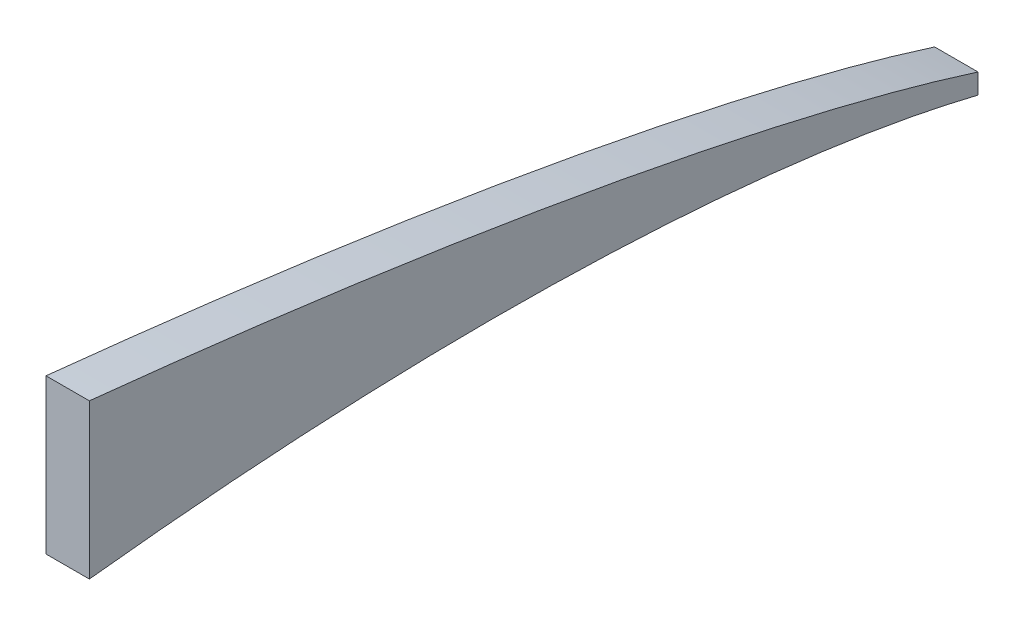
ISO-10303-21;
HEADER;
FILE_DESCRIPTION(('STEP AP214'),'2;1');
FILE_NAME('part.step','',(''),(''),'','','');
FILE_SCHEMA(('AUTOMOTIVE_DESIGN { 1 0 10303 214 1 1 1 1 }'));
ENDSEC;
DATA;
#1=APPLICATION_CONTEXT('core data for automotive mechanical design processes');
#2=APPLICATION_PROTOCOL_DEFINITION('international standard','automotive_design',2000,#1);
#3=PRODUCT_CONTEXT('',#1,'mechanical');
#4=PRODUCT('Part','Part','',(#3));
#5=PRODUCT_RELATED_PRODUCT_CATEGORY('part','',(#4));
#6=PRODUCT_DEFINITION_FORMATION('','',#4);
#7=PRODUCT_DEFINITION_CONTEXT('part definition',#1,'design');
#8=PRODUCT_DEFINITION('design','',#6,#7);
#9=PRODUCT_DEFINITION_SHAPE('','',#8);
#10=(LENGTH_UNIT() NAMED_UNIT(*) SI_UNIT(.MILLI.,.METRE.));
#11=(NAMED_UNIT(*) PLANE_ANGLE_UNIT() SI_UNIT($,.RADIAN.));
#12=(NAMED_UNIT(*) SI_UNIT($,.STERADIAN.) SOLID_ANGLE_UNIT());
#13=UNCERTAINTY_MEASURE_WITH_UNIT(LENGTH_MEASURE(1.E-05),#10,'distance_accuracy_value','');
#14=(GEOMETRIC_REPRESENTATION_CONTEXT(3) GLOBAL_UNCERTAINTY_ASSIGNED_CONTEXT((#13)) GLOBAL_UNIT_ASSIGNED_CONTEXT((#10,
#11,#12)) REPRESENTATION_CONTEXT('',''));
#15=CARTESIAN_POINT('',(0.,0.,0.));
#16=DIRECTION('',(0.,0.,1.));
#17=DIRECTION('',(1.,0.,0.));
#18=AXIS2_PLACEMENT_3D('',#15,#16,#17);
#19=CARTESIAN_POINT('',(3.175,6.66369888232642,-133.35));
#20=CARTESIAN_POINT('',(3.175,6.76675254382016,-133.02843554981));
#21=CARTESIAN_POINT('',(3.175,7.20907024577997,-131.624319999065));
#22=CARTESIAN_POINT('',(3.175,7.97363576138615,-129.022322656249));
#23=CARTESIAN_POINT('',(3.175,8.93748578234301,-125.436266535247));
#24=CARTESIAN_POINT('',(3.175,9.8985001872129,-121.543710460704));
#25=CARTESIAN_POINT('',(3.175,10.8497242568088,-117.366970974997));
#26=CARTESIAN_POINT('',(3.175,11.7852170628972,-112.93094238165));
#27=CARTESIAN_POINT('',(3.175,12.7001679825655,-108.26271343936));
#28=CARTESIAN_POINT('',(3.175,13.5833283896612,-103.389565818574));
#29=CARTESIAN_POINT('',(3.175,14.4334283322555,-98.3421881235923));
#30=CARTESIAN_POINT('',(3.175,15.2395335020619,-93.1496667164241));
#31=CARTESIAN_POINT('',(3.175,16.003202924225,-87.8455840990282));
#32=CARTESIAN_POINT('',(3.175,16.718387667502,-82.4639327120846));
#33=CARTESIAN_POINT('',(3.175,17.3827916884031,-77.0436928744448));
#34=CARTESIAN_POINT('',(3.175,17.9237404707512,-72.3056898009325));
#35=CARTESIAN_POINT('',(3.175,18.2331534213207,-69.3782748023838));
#36=CARTESIAN_POINT('',(3.175,18.3471431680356,-68.2625));
#37=B_SPLINE_CURVE_WITH_KNOTS('',3,(#19,#20,#21,#22,#23,#24,#25,#26,#27,#28,#29,#30,#31,#32,#33,
#34,#35,#36),.UNSPECIFIED.,.F.,.F.,(4,1,1,1,1,1,1,1,1,1,1,1,1,1,1,4),(1.04739946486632,
1.05071030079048,1.06183322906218,1.07398925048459,1.08711817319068,1.10114504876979,
1.11599063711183,1.13157042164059,1.14778837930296,1.16455091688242,1.18175789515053,
1.19931195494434,1.21709507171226,1.23499022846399,1.25285688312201,1.26385443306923),.UNSPECIFIED.);
#38=DIRECTION('',(-1.,0.,0.));
#39=VECTOR('',#38,1.);
#40=SURFACE_OF_LINEAR_EXTRUSION('',#37,#39);
#41=CARTESIAN_POINT('',(0.,6.66369888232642,-133.35));
#42=CARTESIAN_POINT('',(0.,6.76675254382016,-133.02843554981));
#43=CARTESIAN_POINT('',(0.,7.20907024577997,-131.624319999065));
#44=CARTESIAN_POINT('',(0.,7.97363576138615,-129.022322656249));
#45=CARTESIAN_POINT('',(0.,8.93748578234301,-125.436266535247));
#46=CARTESIAN_POINT('',(0.,9.8985001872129,-121.543710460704));
#47=CARTESIAN_POINT('',(0.,10.8497242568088,-117.366970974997));
#48=CARTESIAN_POINT('',(0.,11.7852170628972,-112.93094238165));
#49=CARTESIAN_POINT('',(0.,12.7001679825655,-108.26271343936));
#50=CARTESIAN_POINT('',(0.,13.5833283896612,-103.389565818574));
#51=CARTESIAN_POINT('',(0.,14.4334283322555,-98.3421881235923));
#52=CARTESIAN_POINT('',(0.,15.2395335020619,-93.1496667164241));
#53=CARTESIAN_POINT('',(0.,16.003202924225,-87.8455840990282));
#54=CARTESIAN_POINT('',(0.,16.718387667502,-82.4639327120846));
#55=CARTESIAN_POINT('',(0.,17.3827916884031,-77.0436928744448));
#56=CARTESIAN_POINT('',(0.,17.9237404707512,-72.3056898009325));
#57=CARTESIAN_POINT('',(0.,18.2331534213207,-69.3782748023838));
#58=CARTESIAN_POINT('',(0.,18.3471431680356,-68.2625));
#59=B_SPLINE_CURVE_WITH_KNOTS('',3,(#41,#42,#43,#44,#45,#46,#47,#48,#49,#50,#51,#52,#53,#54,#55,
#56,#57,#58),.UNSPECIFIED.,.F.,.F.,(4,1,1,1,1,1,1,1,1,1,1,1,1,1,1,4),(1.04739946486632,
1.05071030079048,1.06183322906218,1.07398925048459,1.08711817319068,1.10114504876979,
1.11599063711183,1.13157042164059,1.14778837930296,1.16455091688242,1.18175789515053,
1.19931195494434,1.21709507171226,1.23499022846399,1.25285688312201,1.26385443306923),.UNSPECIFIED.);
#60=CARTESIAN_POINT('',(0.,6.66369888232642,-133.35));
#61=VERTEX_POINT('',#60);
#62=CARTESIAN_POINT('',(0.,18.3471431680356,-68.2625));
#63=VERTEX_POINT('',#62);
#64=EDGE_CURVE('E116',#61,#63,#59,.T.);
#65=ORIENTED_EDGE('',*,*,#64,.T.);
#66=DIRECTION('',(-1.,0.,0.));
#67=VECTOR('',#66,1.);
#68=CARTESIAN_POINT('',(3.175,18.3471431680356,-68.2625));
#69=LINE('',#68,#67);
#70=CARTESIAN_POINT('',(3.175,18.3471431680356,-68.2625));
#71=VERTEX_POINT('',#70);
#72=EDGE_CURVE('E11',#71,#63,#69,.T.);
#73=ORIENTED_EDGE('',*,*,#72,.F.);
#74=CARTESIAN_POINT('',(3.175,6.66369888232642,-133.35));
#75=VERTEX_POINT('',#74);
#76=EDGE_CURVE('E85',#75,#71,#37,.T.);
#77=ORIENTED_EDGE('',*,*,#76,.F.);
#78=DIRECTION('',(-1.,0.,0.));
#79=VECTOR('',#78,1.);
#80=CARTESIAN_POINT('',(3.175,6.66369888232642,-133.35));
#81=LINE('',#80,#79);
#82=EDGE_CURVE('E93',#75,#61,#81,.T.);
#83=ORIENTED_EDGE('',*,*,#82,.T.);
#84=EDGE_LOOP('',(#65,#73,#77,#83));
#85=FACE_BOUND('',#84,.T.);
#86=ADVANCED_FACE('F33',(#85),#40,.F.);
#87=CARTESIAN_POINT('',(3.175,18.3471431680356,-68.2625));
#88=DIRECTION('',(0.,0.,-1.));
#89=DIRECTION('',(0.,1.,0.));
#90=AXIS2_PLACEMENT_3D('',#87,#88,#89);
#91=PLANE('',#90);
#92=DIRECTION('',(0.,-1.,0.));
#93=VECTOR('',#92,1.);
#94=CARTESIAN_POINT('',(0.,18.3471431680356,-68.2625));
#95=LINE('',#94,#93);
#96=CARTESIAN_POINT('',(0.,7.04085948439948,-68.2625));
#97=VERTEX_POINT('',#96);
#98=EDGE_CURVE('E89',#63,#97,#95,.T.);
#99=ORIENTED_EDGE('',*,*,#98,.T.);
#100=DIRECTION('',(-1.,0.,0.));
#101=VECTOR('',#100,1.);
#102=CARTESIAN_POINT('',(3.175,7.04085948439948,-68.2625));
#103=LINE('',#102,#101);
#104=CARTESIAN_POINT('',(3.175,7.04085948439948,-68.2625));
#105=VERTEX_POINT('',#104);
#106=EDGE_CURVE('E42',#105,#97,#103,.T.);
#107=ORIENTED_EDGE('',*,*,#106,.F.);
#108=DIRECTION('',(0.,-1.,0.));
#109=VECTOR('',#108,1.);
#110=CARTESIAN_POINT('',(3.175,18.3471431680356,-68.2625));
#111=LINE('',#110,#109);
#112=EDGE_CURVE('E80',#71,#105,#111,.T.);
#113=ORIENTED_EDGE('',*,*,#112,.F.);
#114=ORIENTED_EDGE('',*,*,#72,.T.);
#115=EDGE_LOOP('',(#99,#107,#113,#114));
#116=FACE_BOUND('',#115,.T.);
#117=ADVANCED_FACE('F88',(#116),#91,.F.);
#118=CARTESIAN_POINT('',(3.175,7.04085948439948,-68.2625));
#119=CARTESIAN_POINT('',(3.175,7.21039333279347,-69.7819864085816));
#120=CARTESIAN_POINT('',(3.175,7.61144338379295,-73.6250446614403));
#121=CARTESIAN_POINT('',(3.175,8.13388178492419,-79.8029132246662));
#122=CARTESIAN_POINT('',(3.175,8.55029058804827,-86.7743590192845));
#123=CARTESIAN_POINT('',(3.175,8.77815331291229,-93.6864135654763));
#124=CARTESIAN_POINT('',(3.175,8.80490104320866,-100.464089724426));
#125=CARTESIAN_POINT('',(3.175,8.62858387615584,-107.03177133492));
#126=CARTESIAN_POINT('',(3.175,8.25330238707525,-113.314255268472));
#127=CARTESIAN_POINT('',(3.175,7.6838968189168,-119.235995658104));
#128=CARTESIAN_POINT('',(3.175,6.9421697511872,-124.726495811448));
#129=CARTESIAN_POINT('',(3.175,6.10829641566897,-129.386341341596));
#130=CARTESIAN_POINT('',(3.175,5.47878605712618,-132.199931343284));
#131=CARTESIAN_POINT('',(3.175,5.19548158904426,-133.35));
#132=B_SPLINE_CURVE_WITH_KNOTS('',3,(#118,#119,#120,#121,#122,#123,#124,#125,#126,#127,#128,
#129,#130,#131),.UNSPECIFIED.,.F.,.F.,(4,1,1,1,1,1,1,1,1,1,1,4),(0.741102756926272,
0.756094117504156,0.778988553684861,0.801889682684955,0.824566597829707,0.846792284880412,
0.868338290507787,0.888978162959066,0.908492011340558,0.926658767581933,0.943286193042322,
0.954903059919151),.UNSPECIFIED.);
#133=DIRECTION('',(-1.,0.,0.));
#134=VECTOR('',#133,1.);
#135=SURFACE_OF_LINEAR_EXTRUSION('',#132,#134);
#136=CARTESIAN_POINT('',(0.,7.04085948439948,-68.2625));
#137=CARTESIAN_POINT('',(0.,7.21039333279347,-69.7819864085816));
#138=CARTESIAN_POINT('',(0.,7.61144338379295,-73.6250446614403));
#139=CARTESIAN_POINT('',(0.,8.13388178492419,-79.8029132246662));
#140=CARTESIAN_POINT('',(0.,8.55029058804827,-86.7743590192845));
#141=CARTESIAN_POINT('',(0.,8.77815331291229,-93.6864135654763));
#142=CARTESIAN_POINT('',(0.,8.80490104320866,-100.464089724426));
#143=CARTESIAN_POINT('',(0.,8.62858387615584,-107.03177133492));
#144=CARTESIAN_POINT('',(0.,8.25330238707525,-113.314255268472));
#145=CARTESIAN_POINT('',(0.,7.6838968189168,-119.235995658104));
#146=CARTESIAN_POINT('',(0.,6.9421697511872,-124.726495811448));
#147=CARTESIAN_POINT('',(0.,6.10829641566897,-129.386341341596));
#148=CARTESIAN_POINT('',(0.,5.47878605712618,-132.199931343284));
#149=CARTESIAN_POINT('',(0.,5.19548158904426,-133.35));
#150=B_SPLINE_CURVE_WITH_KNOTS('',3,(#136,#137,#138,#139,#140,#141,#142,#143,#144,#145,#146,
#147,#148,#149),.UNSPECIFIED.,.F.,.F.,(4,1,1,1,1,1,1,1,1,1,1,4),(0.741102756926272,
0.756094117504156,0.778988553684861,0.801889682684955,0.824566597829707,0.846792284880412,
0.868338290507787,0.888978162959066,0.908492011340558,0.926658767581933,0.943286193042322,
0.954903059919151),.UNSPECIFIED.);
#151=CARTESIAN_POINT('',(0.,5.19548158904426,-133.35));
#152=VERTEX_POINT('',#151);
#153=EDGE_CURVE('E67',#97,#152,#150,.T.);
#154=ORIENTED_EDGE('',*,*,#153,.T.);
#155=DIRECTION('',(-1.,0.,0.));
#156=VECTOR('',#155,1.);
#157=CARTESIAN_POINT('',(3.175,5.19548158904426,-133.35));
#158=LINE('',#157,#156);
#159=CARTESIAN_POINT('',(3.175,5.19548158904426,-133.35));
#160=VERTEX_POINT('',#159);
#161=EDGE_CURVE('E90',#160,#152,#158,.T.);
#162=ORIENTED_EDGE('',*,*,#161,.F.);
#163=EDGE_CURVE('E83',#105,#160,#132,.T.);
#164=ORIENTED_EDGE('',*,*,#163,.F.);
#165=ORIENTED_EDGE('',*,*,#106,.T.);
#166=EDGE_LOOP('',(#154,#162,#164,#165));
#167=FACE_BOUND('',#166,.T.);
#168=ADVANCED_FACE('F91',(#167),#135,.F.);
#169=CARTESIAN_POINT('',(3.175,6.66369888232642,-133.35));
#170=DIRECTION('',(0.,0.,1.));
#171=DIRECTION('',(1.,0.,0.));
#172=AXIS2_PLACEMENT_3D('',#169,#170,#171);
#173=PLANE('',#172);
#174=DIRECTION('',(0.,1.,0.));
#175=VECTOR('',#174,1.);
#176=CARTESIAN_POINT('',(0.,6.66369888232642,-133.35));
#177=LINE('',#176,#175);
#178=EDGE_CURVE('E73',#152,#61,#177,.T.);
#179=ORIENTED_EDGE('',*,*,#178,.T.);
#180=ORIENTED_EDGE('',*,*,#82,.F.);
#181=DIRECTION('',(0.,1.,0.));
#182=VECTOR('',#181,1.);
#183=CARTESIAN_POINT('',(3.175,6.66369888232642,-133.35));
#184=LINE('',#183,#182);
#185=EDGE_CURVE('E50',#160,#75,#184,.T.);
#186=ORIENTED_EDGE('',*,*,#185,.F.);
#187=ORIENTED_EDGE('',*,*,#161,.T.);
#188=EDGE_LOOP('',(#179,#180,#186,#187));
#189=FACE_BOUND('',#188,.T.);
#190=ADVANCED_FACE('F105',(#189),#173,.F.);
#191=CARTESIAN_POINT('',(3.175,13.96972600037,-101.0788916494));
#192=DIRECTION('',(-1.,0.,0.));
#193=DIRECTION('',(0.,0.,1.));
#194=AXIS2_PLACEMENT_3D('',#191,#192,#193);
#195=PLANE('',#194);
#196=ORIENTED_EDGE('',*,*,#76,.T.);
#197=ORIENTED_EDGE('',*,*,#112,.T.);
#198=ORIENTED_EDGE('',*,*,#163,.T.);
#199=ORIENTED_EDGE('',*,*,#185,.T.);
#200=EDGE_LOOP('',(#196,#197,#198,#199));
#201=FACE_BOUND('',#200,.T.);
#202=ADVANCED_FACE('F81',(#201),#195,.F.);
#203=CARTESIAN_POINT('',(0.,13.96972600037,-101.0788916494));
#204=DIRECTION('',(-1.,0.,0.));
#205=DIRECTION('',(0.,0.,1.));
#206=AXIS2_PLACEMENT_3D('',#203,#204,#205);
#207=PLANE('',#206);
#208=ORIENTED_EDGE('',*,*,#64,.F.);
#209=ORIENTED_EDGE('',*,*,#178,.F.);
#210=ORIENTED_EDGE('',*,*,#153,.F.);
#211=ORIENTED_EDGE('',*,*,#98,.F.);
#212=EDGE_LOOP('',(#208,#209,#210,#211));
#213=FACE_BOUND('',#212,.T.);
#214=ADVANCED_FACE('F133',(#213),#207,.T.);
#215=CLOSED_SHELL('',(#86,#117,#168,#190,#202,#214));
#216=MANIFOLD_SOLID_BREP('B2',#215);
#217=ADVANCED_BREP_SHAPE_REPRESENTATION('',(#18,#216),#14);
#218=SHAPE_DEFINITION_REPRESENTATION(#9,#217);
ENDSEC;
END-ISO-10303-21;
